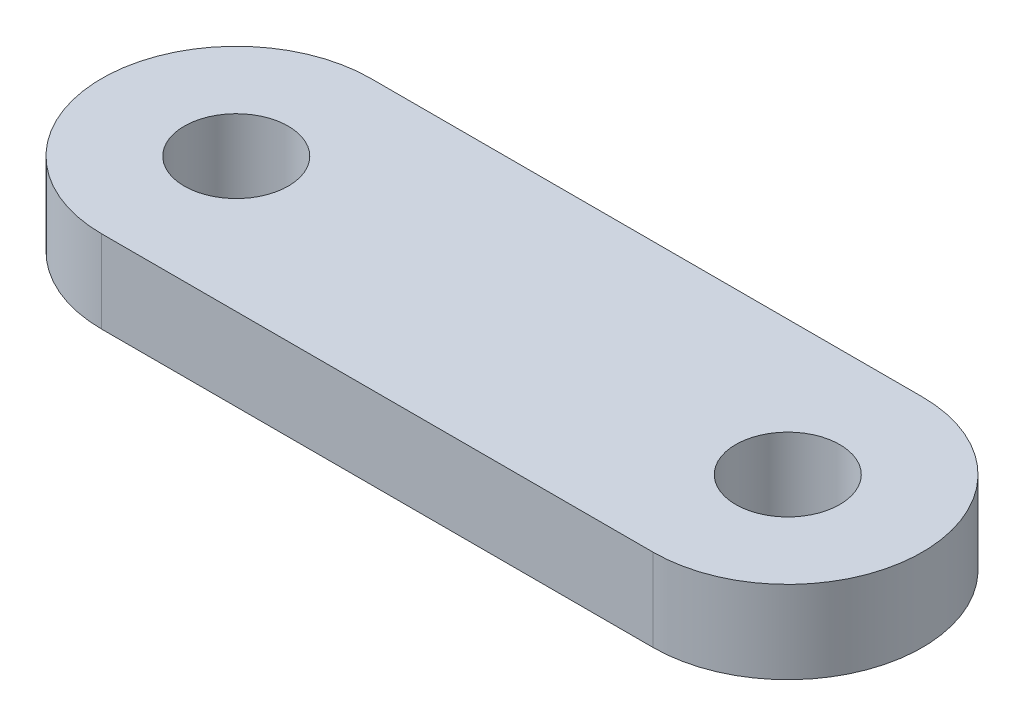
ISO-10303-21;
HEADER;
FILE_DESCRIPTION(('STEP AP214'),'2;1');
FILE_NAME('part.step','',(''),(''),'','','');
FILE_SCHEMA(('AUTOMOTIVE_DESIGN { 1 0 10303 214 1 1 1 1 }'));
ENDSEC;
DATA;
#1=APPLICATION_CONTEXT('core data for automotive mechanical design processes');
#2=APPLICATION_PROTOCOL_DEFINITION('international standard','automotive_design',2000,#1);
#3=PRODUCT_CONTEXT('',#1,'mechanical');
#4=PRODUCT('Part','Part','',(#3));
#5=PRODUCT_RELATED_PRODUCT_CATEGORY('part','',(#4));
#6=PRODUCT_DEFINITION_FORMATION('','',#4);
#7=PRODUCT_DEFINITION_CONTEXT('part definition',#1,'design');
#8=PRODUCT_DEFINITION('design','',#6,#7);
#9=PRODUCT_DEFINITION_SHAPE('','',#8);
#10=(LENGTH_UNIT() NAMED_UNIT(*) SI_UNIT(.MILLI.,.METRE.));
#11=(NAMED_UNIT(*) PLANE_ANGLE_UNIT() SI_UNIT($,.RADIAN.));
#12=(NAMED_UNIT(*) SI_UNIT($,.STERADIAN.) SOLID_ANGLE_UNIT());
#13=UNCERTAINTY_MEASURE_WITH_UNIT(LENGTH_MEASURE(1.E-05),#10,'distance_accuracy_value','');
#14=(GEOMETRIC_REPRESENTATION_CONTEXT(3) GLOBAL_UNCERTAINTY_ASSIGNED_CONTEXT((#13)) GLOBAL_UNIT_ASSIGNED_CONTEXT((#10,
#11,#12)) REPRESENTATION_CONTEXT('',''));
#15=CARTESIAN_POINT('',(0.,0.,0.));
#16=DIRECTION('',(0.,0.,1.));
#17=DIRECTION('',(1.,0.,0.));
#18=AXIS2_PLACEMENT_3D('',#15,#16,#17);
#19=CARTESIAN_POINT('',(-10.6045,1.5875,0.));
#20=DIRECTION('',(0.,1.,0.));
#21=DIRECTION('',(0.,0.,1.));
#22=AXIS2_PLACEMENT_3D('',#19,#20,#21);
#23=PLANE('',#22);
#24=CARTESIAN_POINT('',(-10.6045,1.5875,0.));
#25=DIRECTION('',(0.,1.,0.));
#26=DIRECTION('',(0.,0.,1.));
#27=AXIS2_PLACEMENT_3D('',#24,#25,#26);
#28=CIRCLE('',#27,2.);
#29=CARTESIAN_POINT('',(-10.6045,1.5875,2.));
#30=VERTEX_POINT('',#29);
#31=EDGE_CURVE('E112',#30,#30,#28,.T.);
#32=ORIENTED_EDGE('',*,*,#31,.F.);
#33=EDGE_LOOP('',(#32));
#34=FACE_BOUND('',#33,.T.);
#35=CARTESIAN_POINT('',(-10.6045,1.5875,0.));
#36=DIRECTION('',(0.,1.,0.));
#37=DIRECTION('',(0.,0.,1.));
#38=AXIS2_PLACEMENT_3D('',#35,#36,#37);
#39=CIRCLE('',#38,5.175);
#40=CARTESIAN_POINT('',(-10.6045,1.5875,-5.175));
#41=VERTEX_POINT('',#40);
#42=CARTESIAN_POINT('',(-10.6045,1.5875,5.175));
#43=VERTEX_POINT('',#42);
#44=EDGE_CURVE('E92',#41,#43,#39,.T.);
#45=ORIENTED_EDGE('',*,*,#44,.T.);
#46=DIRECTION('',(1.,0.,0.));
#47=VECTOR('',#46,1.);
#48=CARTESIAN_POINT('',(-10.6045,1.5875,5.175));
#49=LINE('',#48,#47);
#50=CARTESIAN_POINT('',(10.6045,1.5875,5.175));
#51=VERTEX_POINT('',#50);
#52=EDGE_CURVE('E87',#43,#51,#49,.T.);
#53=ORIENTED_EDGE('',*,*,#52,.T.);
#54=CARTESIAN_POINT('',(10.6045,1.5875,0.));
#55=DIRECTION('',(0.,1.,0.));
#56=DIRECTION('',(0.,0.,1.));
#57=AXIS2_PLACEMENT_3D('',#54,#55,#56);
#58=CIRCLE('',#57,5.175);
#59=CARTESIAN_POINT('',(10.6045,1.5875,-5.175));
#60=VERTEX_POINT('',#59);
#61=EDGE_CURVE('E90',#51,#60,#58,.T.);
#62=ORIENTED_EDGE('',*,*,#61,.T.);
#63=DIRECTION('',(-1.,0.,0.));
#64=VECTOR('',#63,1.);
#65=CARTESIAN_POINT('',(-10.6045,1.5875,-5.175));
#66=LINE('',#65,#64);
#67=EDGE_CURVE('E57',#60,#41,#66,.T.);
#68=ORIENTED_EDGE('',*,*,#67,.T.);
#69=EDGE_LOOP('',(#45,#53,#62,#68));
#70=FACE_BOUND('',#69,.T.);
#71=CARTESIAN_POINT('',(10.6045,1.5875,0.));
#72=DIRECTION('',(0.,1.,0.));
#73=DIRECTION('',(0.,0.,1.));
#74=AXIS2_PLACEMENT_3D('',#71,#72,#73);
#75=CIRCLE('',#74,2.);
#76=CARTESIAN_POINT('',(10.6045,1.5875,2.));
#77=VERTEX_POINT('',#76);
#78=EDGE_CURVE('E134',#77,#77,#75,.T.);
#79=ORIENTED_EDGE('',*,*,#78,.F.);
#80=EDGE_LOOP('',(#79));
#81=FACE_BOUND('',#80,.T.);
#82=ADVANCED_FACE('F39',(#34,#70,#81),#23,.T.);
#83=CARTESIAN_POINT('',(-10.6045,-1.5875,0.));
#84=DIRECTION('',(0.,1.,0.));
#85=DIRECTION('',(0.,0.,1.));
#86=AXIS2_PLACEMENT_3D('',#83,#84,#85);
#87=PLANE('',#86);
#88=CARTESIAN_POINT('',(-10.6045,-1.5875,0.));
#89=DIRECTION('',(0.,1.,0.));
#90=DIRECTION('',(0.,0.,1.));
#91=AXIS2_PLACEMENT_3D('',#88,#89,#90);
#92=CIRCLE('',#91,5.175);
#93=CARTESIAN_POINT('',(-10.6045,-1.5875,-5.175));
#94=VERTEX_POINT('',#93);
#95=CARTESIAN_POINT('',(-10.6045,-1.5875,5.175));
#96=VERTEX_POINT('',#95);
#97=EDGE_CURVE('E108',#94,#96,#92,.T.);
#98=ORIENTED_EDGE('',*,*,#97,.F.);
#99=DIRECTION('',(-1.,0.,0.));
#100=VECTOR('',#99,1.);
#101=CARTESIAN_POINT('',(-10.6045,-1.5875,-5.175));
#102=LINE('',#101,#100);
#103=CARTESIAN_POINT('',(10.6045,-1.5875,-5.175));
#104=VERTEX_POINT('',#103);
#105=EDGE_CURVE('E80',#104,#94,#102,.T.);
#106=ORIENTED_EDGE('',*,*,#105,.F.);
#107=CARTESIAN_POINT('',(10.6045,-1.5875,0.));
#108=DIRECTION('',(0.,1.,0.));
#109=DIRECTION('',(0.,0.,1.));
#110=AXIS2_PLACEMENT_3D('',#107,#108,#109);
#111=CIRCLE('',#110,5.175);
#112=CARTESIAN_POINT('',(10.6045,-1.5875,5.175));
#113=VERTEX_POINT('',#112);
#114=EDGE_CURVE('E74',#113,#104,#111,.T.);
#115=ORIENTED_EDGE('',*,*,#114,.F.);
#116=DIRECTION('',(1.,0.,0.));
#117=VECTOR('',#116,1.);
#118=CARTESIAN_POINT('',(-10.6045,-1.5875,5.175));
#119=LINE('',#118,#117);
#120=EDGE_CURVE('E97',#96,#113,#119,.T.);
#121=ORIENTED_EDGE('',*,*,#120,.F.);
#122=EDGE_LOOP('',(#98,#106,#115,#121));
#123=FACE_BOUND('',#122,.T.);
#124=CARTESIAN_POINT('',(-10.6045,-1.5875,0.));
#125=DIRECTION('',(0.,1.,0.));
#126=DIRECTION('',(0.,0.,1.));
#127=AXIS2_PLACEMENT_3D('',#124,#125,#126);
#128=CIRCLE('',#127,2.);
#129=CARTESIAN_POINT('',(-10.6045,-1.5875,2.));
#130=VERTEX_POINT('',#129);
#131=EDGE_CURVE('E130',#130,#130,#128,.T.);
#132=ORIENTED_EDGE('',*,*,#131,.T.);
#133=EDGE_LOOP('',(#132));
#134=FACE_BOUND('',#133,.T.);
#135=CARTESIAN_POINT('',(10.6045,-1.5875,0.));
#136=DIRECTION('',(0.,1.,0.));
#137=DIRECTION('',(0.,0.,1.));
#138=AXIS2_PLACEMENT_3D('',#135,#136,#137);
#139=CIRCLE('',#138,2.);
#140=CARTESIAN_POINT('',(10.6045,-1.5875,2.));
#141=VERTEX_POINT('',#140);
#142=EDGE_CURVE('E138',#141,#141,#139,.T.);
#143=ORIENTED_EDGE('',*,*,#142,.T.);
#144=EDGE_LOOP('',(#143));
#145=FACE_BOUND('',#144,.T.);
#146=ADVANCED_FACE('F125',(#123,#134,#145),#87,.F.);
#147=CARTESIAN_POINT('',(-10.6045,1.5875,0.));
#148=DIRECTION('',(0.,-1.,0.));
#149=DIRECTION('',(0.,0.,-1.));
#150=AXIS2_PLACEMENT_3D('',#147,#148,#149);
#151=CYLINDRICAL_SURFACE('',#150,5.175);
#152=ORIENTED_EDGE('',*,*,#97,.T.);
#153=DIRECTION('',(0.,-1.,0.));
#154=VECTOR('',#153,1.);
#155=CARTESIAN_POINT('',(-10.6045,1.5875,5.175));
#156=LINE('',#155,#154);
#157=EDGE_CURVE('E11',#43,#96,#156,.T.);
#158=ORIENTED_EDGE('',*,*,#157,.F.);
#159=ORIENTED_EDGE('',*,*,#44,.F.);
#160=DIRECTION('',(0.,-1.,0.));
#161=VECTOR('',#160,1.);
#162=CARTESIAN_POINT('',(-10.6045,1.5875,-5.175));
#163=LINE('',#162,#161);
#164=EDGE_CURVE('E104',#41,#94,#163,.T.);
#165=ORIENTED_EDGE('',*,*,#164,.T.);
#166=EDGE_LOOP('',(#152,#158,#159,#165));
#167=FACE_BOUND('',#166,.T.);
#168=ADVANCED_FACE('F41',(#167),#151,.T.);
#169=CARTESIAN_POINT('',(-10.6045,1.5875,5.175));
#170=DIRECTION('',(0.,0.,-1.));
#171=DIRECTION('',(-1.,0.,0.));
#172=AXIS2_PLACEMENT_3D('',#169,#170,#171);
#173=PLANE('',#172);
#174=ORIENTED_EDGE('',*,*,#120,.T.);
#175=DIRECTION('',(0.,-1.,0.));
#176=VECTOR('',#175,1.);
#177=CARTESIAN_POINT('',(10.6045,1.5875,5.175));
#178=LINE('',#177,#176);
#179=EDGE_CURVE('E49',#51,#113,#178,.T.);
#180=ORIENTED_EDGE('',*,*,#179,.F.);
#181=ORIENTED_EDGE('',*,*,#52,.F.);
#182=ORIENTED_EDGE('',*,*,#157,.T.);
#183=EDGE_LOOP('',(#174,#180,#181,#182));
#184=FACE_BOUND('',#183,.T.);
#185=ADVANCED_FACE('F96',(#184),#173,.F.);
#186=CARTESIAN_POINT('',(10.6045,1.5875,0.));
#187=DIRECTION('',(0.,-1.,0.));
#188=DIRECTION('',(0.,0.,-1.));
#189=AXIS2_PLACEMENT_3D('',#186,#187,#188);
#190=CYLINDRICAL_SURFACE('',#189,5.175);
#191=ORIENTED_EDGE('',*,*,#114,.T.);
#192=DIRECTION('',(0.,-1.,0.));
#193=VECTOR('',#192,1.);
#194=CARTESIAN_POINT('',(10.6045,1.5875,-5.175));
#195=LINE('',#194,#193);
#196=EDGE_CURVE('E99',#60,#104,#195,.T.);
#197=ORIENTED_EDGE('',*,*,#196,.F.);
#198=ORIENTED_EDGE('',*,*,#61,.F.);
#199=ORIENTED_EDGE('',*,*,#179,.T.);
#200=EDGE_LOOP('',(#191,#197,#198,#199));
#201=FACE_BOUND('',#200,.T.);
#202=ADVANCED_FACE('F100',(#201),#190,.T.);
#203=CARTESIAN_POINT('',(-10.6045,1.5875,-5.175));
#204=DIRECTION('',(0.,0.,1.));
#205=DIRECTION('',(1.,0.,0.));
#206=AXIS2_PLACEMENT_3D('',#203,#204,#205);
#207=PLANE('',#206);
#208=ORIENTED_EDGE('',*,*,#105,.T.);
#209=ORIENTED_EDGE('',*,*,#164,.F.);
#210=ORIENTED_EDGE('',*,*,#67,.F.);
#211=ORIENTED_EDGE('',*,*,#196,.T.);
#212=EDGE_LOOP('',(#208,#209,#210,#211));
#213=FACE_BOUND('',#212,.T.);
#214=ADVANCED_FACE('F122',(#213),#207,.F.);
#215=CARTESIAN_POINT('',(-10.6045,1.5875,0.));
#216=DIRECTION('',(0.,-1.,0.));
#217=DIRECTION('',(0.,0.,-1.));
#218=AXIS2_PLACEMENT_3D('',#215,#216,#217);
#219=CYLINDRICAL_SURFACE('',#218,2.);
#220=ORIENTED_EDGE('',*,*,#31,.T.);
#221=EDGE_LOOP('',(#220));
#222=FACE_BOUND('',#221,.T.);
#223=ORIENTED_EDGE('',*,*,#131,.F.);
#224=EDGE_LOOP('',(#223));
#225=FACE_BOUND('',#224,.T.);
#226=ADVANCED_FACE('F157',(#222,#225),#219,.F.);
#227=CARTESIAN_POINT('',(10.6045,1.5875,0.));
#228=DIRECTION('',(0.,-1.,0.));
#229=DIRECTION('',(0.,0.,-1.));
#230=AXIS2_PLACEMENT_3D('',#227,#228,#229);
#231=CYLINDRICAL_SURFACE('',#230,2.);
#232=ORIENTED_EDGE('',*,*,#78,.T.);
#233=EDGE_LOOP('',(#232));
#234=FACE_BOUND('',#233,.T.);
#235=ORIENTED_EDGE('',*,*,#142,.F.);
#236=EDGE_LOOP('',(#235));
#237=FACE_BOUND('',#236,.T.);
#238=ADVANCED_FACE('F146',(#234,#237),#231,.F.);
#239=CLOSED_SHELL('',(#82,#146,#168,#185,#202,#214,#226,#238));
#240=MANIFOLD_SOLID_BREP('B2',#239);
#241=ADVANCED_BREP_SHAPE_REPRESENTATION('',(#18,#240),#14);
#242=SHAPE_DEFINITION_REPRESENTATION(#9,#241);
ENDSEC;
END-ISO-10303-21;
